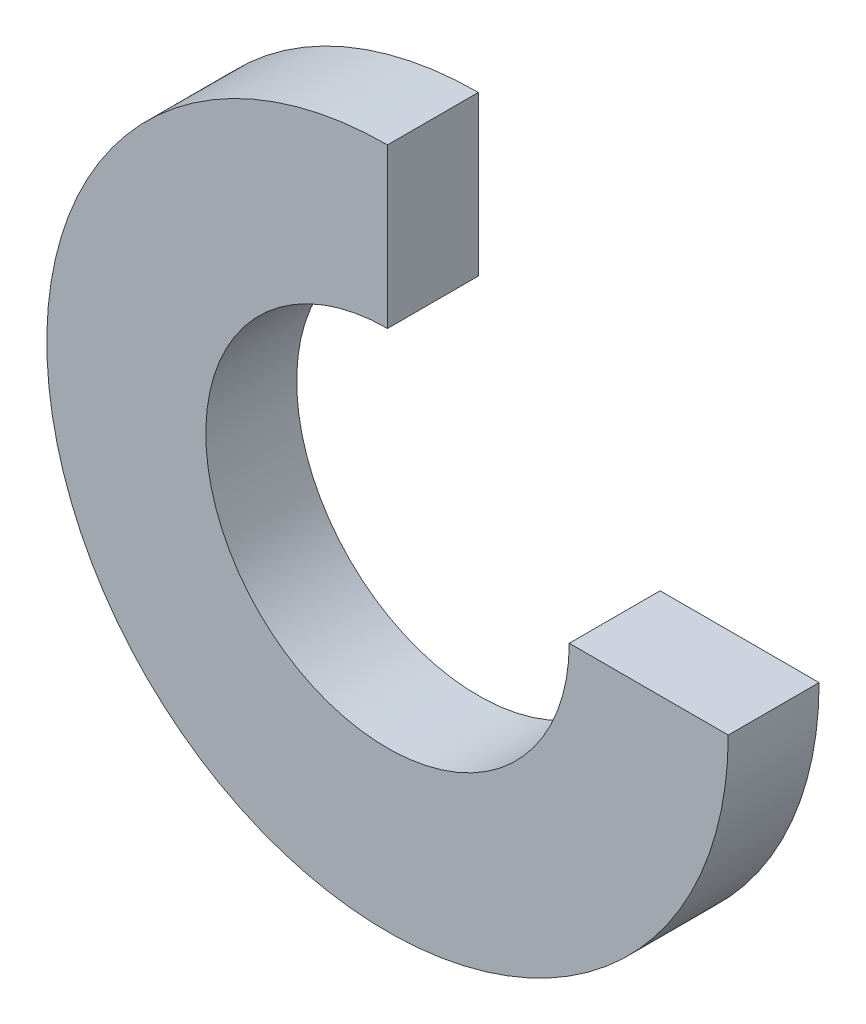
ISO-10303-21;
HEADER;
FILE_DESCRIPTION(('STEP AP214'),'2;1');
FILE_NAME('part.step','',(''),(''),'','','');
FILE_SCHEMA(('AUTOMOTIVE_DESIGN { 1 0 10303 214 1 1 1 1 }'));
ENDSEC;
DATA;
#1=APPLICATION_CONTEXT('core data for automotive mechanical design processes');
#2=APPLICATION_PROTOCOL_DEFINITION('international standard','automotive_design',2000,#1);
#3=PRODUCT_CONTEXT('',#1,'mechanical');
#4=PRODUCT('Part','Part','',(#3));
#5=PRODUCT_RELATED_PRODUCT_CATEGORY('part','',(#4));
#6=PRODUCT_DEFINITION_FORMATION('','',#4);
#7=PRODUCT_DEFINITION_CONTEXT('part definition',#1,'design');
#8=PRODUCT_DEFINITION('design','',#6,#7);
#9=PRODUCT_DEFINITION_SHAPE('','',#8);
#10=(LENGTH_UNIT() NAMED_UNIT(*) SI_UNIT(.MILLI.,.METRE.));
#11=(NAMED_UNIT(*) PLANE_ANGLE_UNIT() SI_UNIT($,.RADIAN.));
#12=(NAMED_UNIT(*) SI_UNIT($,.STERADIAN.) SOLID_ANGLE_UNIT());
#13=UNCERTAINTY_MEASURE_WITH_UNIT(LENGTH_MEASURE(1.E-05),#10,'distance_accuracy_value','');
#14=(GEOMETRIC_REPRESENTATION_CONTEXT(3) GLOBAL_UNCERTAINTY_ASSIGNED_CONTEXT((#13)) GLOBAL_UNIT_ASSIGNED_CONTEXT((#10,
#11,#12)) REPRESENTATION_CONTEXT('',''));
#15=CARTESIAN_POINT('',(0.,0.,0.));
#16=DIRECTION('',(0.,0.,1.));
#17=DIRECTION('',(1.,0.,0.));
#18=AXIS2_PLACEMENT_3D('',#15,#16,#17);
#19=CARTESIAN_POINT('',(-1.2490009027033E-13,0.,1.99999999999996));
#20=DIRECTION('',(0.,0.,-1.));
#21=DIRECTION('',(-1.00000000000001,0.,0.));
#22=AXIS2_PLACEMENT_3D('',#19,#20,#21);
#23=CYLINDRICAL_SURFACE('',#22,4.);
#24=CARTESIAN_POINT('',(0.,0.,0.));
#25=DIRECTION('',(0.,0.,-1.));
#26=DIRECTION('',(1.00000000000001,0.,0.));
#27=AXIS2_PLACEMENT_3D('',#24,#25,#26);
#28=CIRCLE('',#27,4.);
#29=CARTESIAN_POINT('',(3.9999999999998,4.16333634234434E-13,0.));
#30=VERTEX_POINT('',#29);
#31=CARTESIAN_POINT('',(0.,4.,0.));
#32=VERTEX_POINT('',#31);
#33=EDGE_CURVE('E70',#30,#32,#28,.T.);
#34=ORIENTED_EDGE('',*,*,#33,.T.);
#35=DIRECTION('',(0.,0.,-1.));
#36=VECTOR('',#35,1.);
#37=CARTESIAN_POINT('',(0.,4.,2.));
#38=LINE('',#37,#36);
#39=CARTESIAN_POINT('',(0.,4.,2.));
#40=VERTEX_POINT('',#39);
#41=EDGE_CURVE('E11',#40,#32,#38,.T.);
#42=ORIENTED_EDGE('',*,*,#41,.F.);
#43=CARTESIAN_POINT('',(-1.2490009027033E-13,0.,1.99999999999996));
#44=DIRECTION('',(0.,0.,-1.));
#45=DIRECTION('',(1.00000000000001,0.,0.));
#46=AXIS2_PLACEMENT_3D('',#43,#44,#45);
#47=CIRCLE('',#46,4.);
#48=CARTESIAN_POINT('',(3.99999999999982,4.44089209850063E-13,1.99999999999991));
#49=VERTEX_POINT('',#48);
#50=EDGE_CURVE('E88',#49,#40,#47,.T.);
#51=ORIENTED_EDGE('',*,*,#50,.F.);
#52=DIRECTION('',(0.,0.,-1.));
#53=VECTOR('',#52,1.);
#54=CARTESIAN_POINT('',(3.99999999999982,4.44089209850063E-13,1.99999999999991));
#55=LINE('',#54,#53);
#56=EDGE_CURVE('E82',#49,#30,#55,.T.);
#57=ORIENTED_EDGE('',*,*,#56,.T.);
#58=EDGE_LOOP('',(#34,#42,#51,#57));
#59=FACE_BOUND('',#58,.T.);
#60=ADVANCED_FACE('F26',(#59),#23,.F.);
#61=CARTESIAN_POINT('',(0.,4.,2.));
#62=DIRECTION('',(-1.00000000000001,0.,0.));
#63=DIRECTION('',(0.,0.,1.));
#64=AXIS2_PLACEMENT_3D('',#61,#62,#63);
#65=PLANE('',#64);
#66=DIRECTION('',(0.,1.,0.));
#67=VECTOR('',#66,1.);
#68=CARTESIAN_POINT('',(0.,4.,0.));
#69=LINE('',#68,#67);
#70=CARTESIAN_POINT('',(0.,7.49999999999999,0.));
#71=VERTEX_POINT('',#70);
#72=EDGE_CURVE('E66',#32,#71,#69,.T.);
#73=ORIENTED_EDGE('',*,*,#72,.T.);
#74=DIRECTION('',(0.,0.,-1.));
#75=VECTOR('',#74,1.);
#76=CARTESIAN_POINT('',(1.11022302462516E-13,7.50000000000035,1.99999999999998));
#77=LINE('',#76,#75);
#78=CARTESIAN_POINT('',(1.11022302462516E-13,7.50000000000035,1.99999999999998));
#79=VERTEX_POINT('',#78);
#80=EDGE_CURVE('E33',#79,#71,#77,.T.);
#81=ORIENTED_EDGE('',*,*,#80,.F.);
#82=DIRECTION('',(0.,1.,0.));
#83=VECTOR('',#82,1.);
#84=CARTESIAN_POINT('',(0.,4.,2.));
#85=LINE('',#84,#83);
#86=EDGE_CURVE('E78',#40,#79,#85,.T.);
#87=ORIENTED_EDGE('',*,*,#86,.F.);
#88=ORIENTED_EDGE('',*,*,#41,.T.);
#89=EDGE_LOOP('',(#73,#81,#87,#88));
#90=FACE_BOUND('',#89,.T.);
#91=ADVANCED_FACE('F77',(#90),#65,.F.);
#92=CARTESIAN_POINT('',(-1.2490009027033E-13,0.,1.99999999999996));
#93=DIRECTION('',(0.,0.,-1.));
#94=DIRECTION('',(-1.00000000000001,0.,0.));
#95=AXIS2_PLACEMENT_3D('',#92,#93,#94);
#96=CYLINDRICAL_SURFACE('',#95,7.5);
#97=CARTESIAN_POINT('',(0.,0.,0.));
#98=DIRECTION('',(0.,0.,1.));
#99=DIRECTION('',(1.00000000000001,0.,0.));
#100=AXIS2_PLACEMENT_3D('',#97,#98,#99);
#101=CIRCLE('',#100,7.5);
#102=CARTESIAN_POINT('',(7.49999999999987,2.02615701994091E-12,0.));
#103=VERTEX_POINT('',#102);
#104=EDGE_CURVE('E71',#71,#103,#101,.T.);
#105=ORIENTED_EDGE('',*,*,#104,.T.);
#106=DIRECTION('',(0.,0.,-1.));
#107=VECTOR('',#106,1.);
#108=CARTESIAN_POINT('',(7.5,0.,2.));
#109=LINE('',#108,#107);
#110=CARTESIAN_POINT('',(7.5,0.,2.));
#111=VERTEX_POINT('',#110);
#112=EDGE_CURVE('E94',#111,#103,#109,.T.);
#113=ORIENTED_EDGE('',*,*,#112,.F.);
#114=CARTESIAN_POINT('',(-1.2490009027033E-13,0.,1.99999999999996));
#115=DIRECTION('',(0.,0.,1.));
#116=DIRECTION('',(1.00000000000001,0.,0.));
#117=AXIS2_PLACEMENT_3D('',#114,#115,#116);
#118=CIRCLE('',#117,7.5);
#119=EDGE_CURVE('E45',#79,#111,#118,.T.);
#120=ORIENTED_EDGE('',*,*,#119,.F.);
#121=ORIENTED_EDGE('',*,*,#80,.T.);
#122=EDGE_LOOP('',(#105,#113,#120,#121));
#123=FACE_BOUND('',#122,.T.);
#124=ADVANCED_FACE('F97',(#123),#96,.T.);
#125=CARTESIAN_POINT('',(3.99999999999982,4.44089209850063E-13,1.99999999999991));
#126=DIRECTION('',(0.,-1.,0.));
#127=DIRECTION('',(0.,0.,-1.));
#128=AXIS2_PLACEMENT_3D('',#125,#126,#127);
#129=PLANE('',#128);
#130=DIRECTION('',(-1.00000000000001,0.,0.));
#131=VECTOR('',#130,1.);
#132=CARTESIAN_POINT('',(3.9999999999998,4.16333634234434E-13,0.));
#133=LINE('',#132,#131);
#134=EDGE_CURVE('E86',#103,#30,#133,.T.);
#135=ORIENTED_EDGE('',*,*,#134,.T.);
#136=ORIENTED_EDGE('',*,*,#56,.F.);
#137=DIRECTION('',(-1.00000000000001,0.,0.));
#138=VECTOR('',#137,1.);
#139=CARTESIAN_POINT('',(3.99999999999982,4.44089209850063E-13,1.99999999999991));
#140=LINE('',#139,#138);
#141=EDGE_CURVE('E40',#111,#49,#140,.T.);
#142=ORIENTED_EDGE('',*,*,#141,.F.);
#143=ORIENTED_EDGE('',*,*,#112,.T.);
#144=EDGE_LOOP('',(#135,#136,#142,#143));
#145=FACE_BOUND('',#144,.T.);
#146=ADVANCED_FACE('F99',(#145),#129,.F.);
#147=CARTESIAN_POINT('',(-1.2490009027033E-13,0.,1.99999999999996));
#148=DIRECTION('',(0.,0.,1.));
#149=DIRECTION('',(1.00000000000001,0.,0.));
#150=AXIS2_PLACEMENT_3D('',#147,#148,#149);
#151=PLANE('',#150);
#152=ORIENTED_EDGE('',*,*,#50,.T.);
#153=ORIENTED_EDGE('',*,*,#86,.T.);
#154=ORIENTED_EDGE('',*,*,#119,.T.);
#155=ORIENTED_EDGE('',*,*,#141,.T.);
#156=EDGE_LOOP('',(#152,#153,#154,#155));
#157=FACE_BOUND('',#156,.T.);
#158=ADVANCED_FACE('F100',(#157),#151,.T.);
#159=CARTESIAN_POINT('',(0.,0.,0.));
#160=DIRECTION('',(0.,0.,1.));
#161=DIRECTION('',(1.00000000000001,0.,0.));
#162=AXIS2_PLACEMENT_3D('',#159,#160,#161);
#163=PLANE('',#162);
#164=ORIENTED_EDGE('',*,*,#33,.F.);
#165=ORIENTED_EDGE('',*,*,#134,.F.);
#166=ORIENTED_EDGE('',*,*,#104,.F.);
#167=ORIENTED_EDGE('',*,*,#72,.F.);
#168=EDGE_LOOP('',(#164,#165,#166,#167));
#169=FACE_BOUND('',#168,.T.);
#170=ADVANCED_FACE('F67',(#169),#163,.F.);
#171=CLOSED_SHELL('',(#60,#91,#124,#146,#158,#170));
#172=MANIFOLD_SOLID_BREP('B2',#171);
#173=ADVANCED_BREP_SHAPE_REPRESENTATION('',(#18,#172),#14);
#174=SHAPE_DEFINITION_REPRESENTATION(#9,#173);
ENDSEC;
END-ISO-10303-21;
